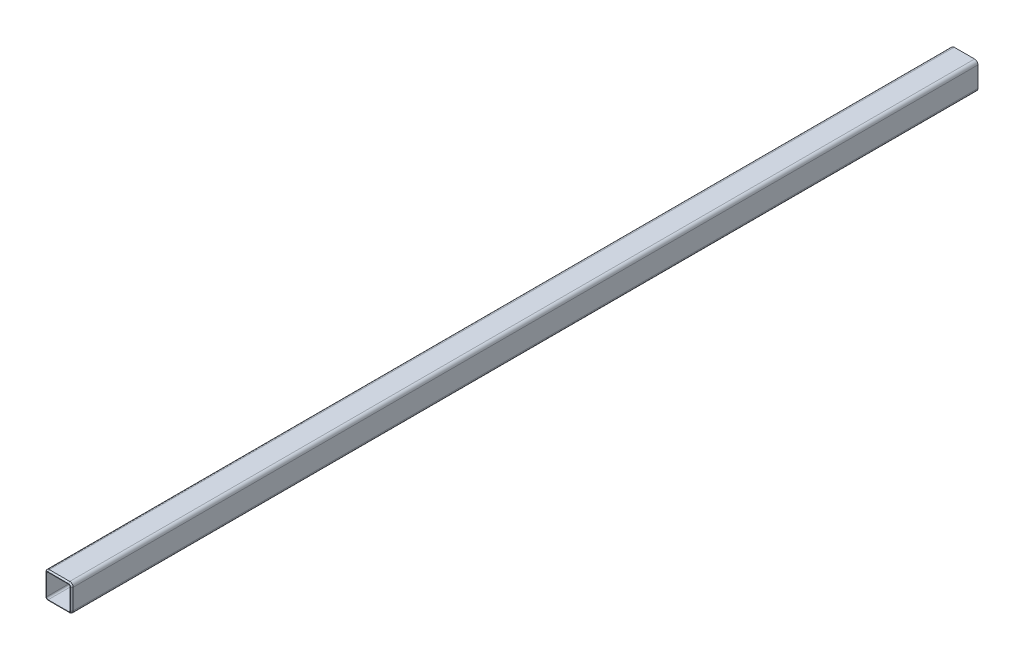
from build123d import *

# Parameters (mm, degrees)
BOSS_EXTRUDE1_DEPTH      = 6680.93
BOSS_EXTRUDE1_DEPTH_BACK = 101.6
CHAMFER1_SIZE            = 9.525


with BuildPart() as part:
    # 8in beam → Boss-Extrude1 (new, two sides: drawn at the far end of the back side and taken through both)
    with BuildSketch(Plane(origin=(0, 0, 0), x_dir=(0, 1, 0), z_dir=(0, 0, 1)).offset(-BOSS_EXTRUDE1_DEPTH_BACK)):
        with BuildLine():
            Line((-76.2, -101.6), (76.2, -101.6))
            ThreePointArc((76.2, -101.6), (94.160512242, -94.160512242), (101.6, -76.2))
            Line((101.6, -76.2), (101.6, 76.2))
            ThreePointArc((101.6, 76.2), (94.160512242, 94.160512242), (76.2, 101.6))
            Line((76.2, 101.6), (-76.2, 101.6))
            ThreePointArc((-76.2, 101.6), (-94.160512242, 94.160512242), (-101.6, 76.2))
            Line((-101.6, 76.2), (-101.6, -76.2))
            ThreePointArc((-101.6, -76.2), (-94.160512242, -94.160512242), (-76.2, -101.6))
        make_face()
        with BuildLine():
            Line((-76.2, -88.9), (76.2, -88.9))
            ThreePointArc((76.2, -88.9), (85.180256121, -85.180256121), (88.9, -76.2))
            Line((88.9, -76.2), (88.9, 76.2))
            ThreePointArc((88.9, 76.2), (85.180256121, 85.180256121), (76.2, 88.9))
            Line((76.2, 88.9), (-76.2, 88.9))
            ThreePointArc((-76.2, 88.9), (-85.180256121, 85.180256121), (-88.9, 76.2))
            Line((-88.9, 76.2), (-88.9, -76.2))
            ThreePointArc((-88.9, -76.2), (-85.180256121, -85.180256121), (-76.2, -88.9))
        make_face(mode=Mode.SUBTRACT)
    extrude(amount=BOSS_EXTRUDE1_DEPTH + BOSS_EXTRUDE1_DEPTH_BACK)

    # Chamfer1
    chamfer1_edges = [part.edges().sort_by_distance(p)[0] for p in [
        (-94.160512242, 94.160512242, 6680.93),
        (-101.6, 0, 6680.93),
        (-94.160512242, -94.160512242, 6680.93),
        (0, -101.6, 6680.93),
        (94.160512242, -94.160512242, 6680.93),
        (101.6, 0, 6680.93),
        (94.160512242, 94.160512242, 6680.93),
        (0, 101.6, 6680.93),
    ]]
    chamfer(chamfer1_edges, length=CHAMFER1_SIZE)


solid = part.part
